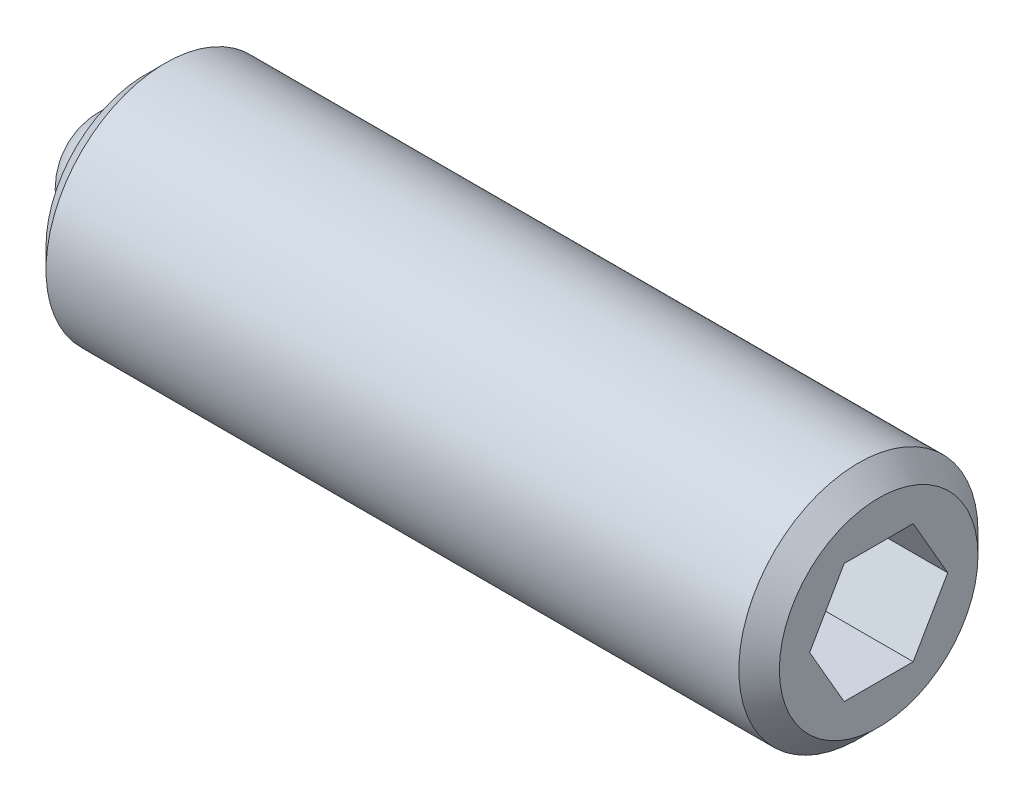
from build123d import *

# Parameters (mm, degrees)
SKETCH2_R           = 1.5
BOSS_EXTRUDE1_DEPTH = 9.2
CHAMFER1_SIZE       = 0.254
CHAMFER2_SIZE       = 0.254
CUT_EXTRUDE2_DEPTH  = 2
SKETCH3_R           = 0.8
CUT_EXTRUDE3_DEPTH  = 0.8


with BuildPart() as part:
    # Sketch2 → Boss-Extrude1 (new body)
    with BuildSketch(Plane(origin=(0, 0, 0), x_dir=(0, 0, -1), z_dir=(1, 0, 0))):
        Circle(SKETCH2_R)
    extrude(amount=BOSS_EXTRUDE1_DEPTH)

    # Chamfer1
    chamfer1_edges = [part.edges().sort_by_distance(p)[0] for p in [
        (0, 0, 1.5),
    ]]
    chamfer(chamfer1_edges, length=CHAMFER1_SIZE)

    # Chamfer2
    chamfer2_edges = [part.edges().sort_by_distance(p)[0] for p in [
        (9.2, 0, 1.5),
    ]]
    chamfer(chamfer2_edges, length=CHAMFER2_SIZE)

    # Sketch4 → Cut-Extrude2 (cut)
    with BuildSketch(Plane(origin=(9.2, 0, 0), x_dir=(0, 0, -1), z_dir=(1, 0, 0))):
        Polygon((0.866025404, 0), (0.433012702, 0.75), (-0.433012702, 0.75), (-0.866025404, 0), (-0.433012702, -0.75), (0.433012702, -0.75), align=None)
    extrude(amount=-CUT_EXTRUDE2_DEPTH, mode=Mode.SUBTRACT)

    # Sketch3 → Cut-Extrude3 (cut)
    with BuildSketch(Plane.ZY):
        Circle(SKETCH3_R)
    extrude(amount=-CUT_EXTRUDE3_DEPTH, mode=Mode.SUBTRACT)


with BuildPart() as body_2:
    # Sketch5 → Revolve1 (revolve)
    with BuildSketch(Plane.ZY):
        with BuildLine():
            Line((0, 0), (0, -0.8))
            ThreePointArc((0, -0.8), (-0.8, 0), (0, 0.8))
            Line((0, 0.8), (0, 0))
        make_face()
    revolve(axis=Axis((0, 0, 0), (0, 1, 0)))


solid = Compound([part.part, body_2.part])
